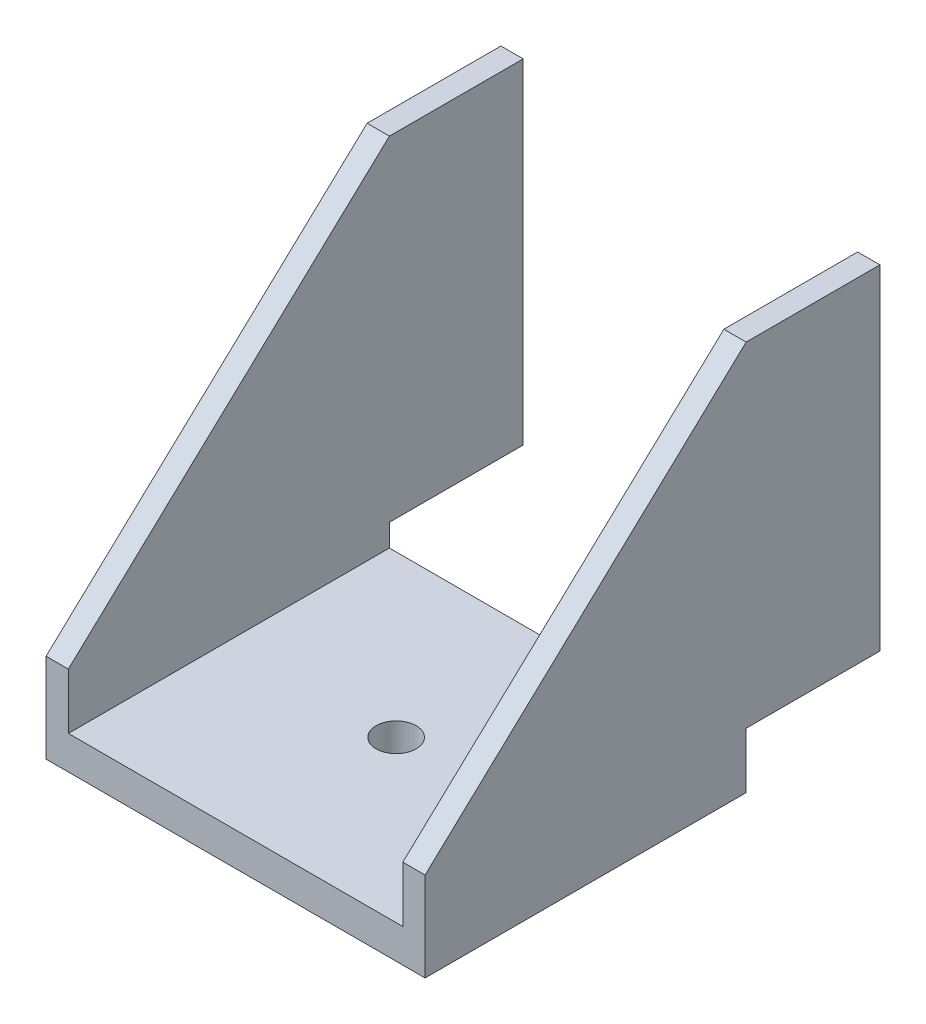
ISO-10303-21;
HEADER;
FILE_DESCRIPTION(('STEP AP214'),'2;1');
FILE_NAME('part.step','',(''),(''),'','','');
FILE_SCHEMA(('AUTOMOTIVE_DESIGN { 1 0 10303 214 1 1 1 1 }'));
ENDSEC;
DATA;
#1=APPLICATION_CONTEXT('core data for automotive mechanical design processes');
#2=APPLICATION_PROTOCOL_DEFINITION('international standard','automotive_design',2000,#1);
#3=PRODUCT_CONTEXT('',#1,'mechanical');
#4=PRODUCT('Part','Part','',(#3));
#5=PRODUCT_RELATED_PRODUCT_CATEGORY('part','',(#4));
#6=PRODUCT_DEFINITION_FORMATION('','',#4);
#7=PRODUCT_DEFINITION_CONTEXT('part definition',#1,'design');
#8=PRODUCT_DEFINITION('design','',#6,#7);
#9=PRODUCT_DEFINITION_SHAPE('','',#8);
#10=(LENGTH_UNIT() NAMED_UNIT(*) SI_UNIT(.MILLI.,.METRE.));
#11=(NAMED_UNIT(*) PLANE_ANGLE_UNIT() SI_UNIT($,.RADIAN.));
#12=(NAMED_UNIT(*) SI_UNIT($,.STERADIAN.) SOLID_ANGLE_UNIT());
#13=UNCERTAINTY_MEASURE_WITH_UNIT(LENGTH_MEASURE(1.E-05),#10,'distance_accuracy_value','');
#14=(GEOMETRIC_REPRESENTATION_CONTEXT(3) GLOBAL_UNCERTAINTY_ASSIGNED_CONTEXT((#13)) GLOBAL_UNIT_ASSIGNED_CONTEXT((#10,
#11,#12)) REPRESENTATION_CONTEXT('',''));
#15=CARTESIAN_POINT('',(0.,0.,0.));
#16=DIRECTION('',(0.,0.,1.));
#17=DIRECTION('',(1.,0.,0.));
#18=AXIS2_PLACEMENT_3D('',#15,#16,#17);
#19=CARTESIAN_POINT('',(0.,-9.99999999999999,0.));
#20=DIRECTION('',(0.,1.,0.));
#21=DIRECTION('',(0.,0.,1.));
#22=AXIS2_PLACEMENT_3D('',#19,#20,#21);
#23=PLANE('',#22);
#24=CARTESIAN_POINT('',(-75.,-10.,72.));
#25=DIRECTION('',(0.,-1.,0.));
#26=DIRECTION('',(0.,0.,-1.));
#27=AXIS2_PLACEMENT_3D('',#24,#25,#26);
#28=CIRCLE('',#27,8.99999999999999);
#29=CARTESIAN_POINT('',(-75.,-10.,63.));
#30=VERTEX_POINT('',#29);
#31=EDGE_CURVE('E350',#30,#30,#28,.T.);
#32=ORIENTED_EDGE('',*,*,#31,.T.);
#33=EDGE_LOOP('',(#32));
#34=FACE_BOUND('',#33,.T.);
#35=DIRECTION('',(1.,0.,0.));
#36=VECTOR('',#35,1.);
#37=CARTESIAN_POINT('',(10.,-9.99999999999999,0.));
#38=LINE('',#37,#36);
#39=CARTESIAN_POINT('',(-150.,-10.,0.));
#40=VERTEX_POINT('',#39);
#41=CARTESIAN_POINT('',(0.,-9.99999999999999,0.));
#42=VERTEX_POINT('',#41);
#43=EDGE_CURVE('E154',#40,#42,#38,.T.);
#44=ORIENTED_EDGE('',*,*,#43,.F.);
#45=DIRECTION('',(0.,0.,1.));
#46=VECTOR('',#45,1.);
#47=CARTESIAN_POINT('',(-150.,-9.99999999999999,0.));
#48=LINE('',#47,#46);
#49=CARTESIAN_POINT('',(-150.,-10.,144.));
#50=VERTEX_POINT('',#49);
#51=EDGE_CURVE('E11',#40,#50,#48,.T.);
#52=ORIENTED_EDGE('',*,*,#51,.T.);
#53=DIRECTION('',(-1.,0.,0.));
#54=VECTOR('',#53,1.);
#55=CARTESIAN_POINT('',(10.,-10.,144.));
#56=LINE('',#55,#54);
#57=CARTESIAN_POINT('',(0.,-10.,144.));
#58=VERTEX_POINT('',#57);
#59=EDGE_CURVE('E156',#58,#50,#56,.T.);
#60=ORIENTED_EDGE('',*,*,#59,.F.);
#61=DIRECTION('',(0.,0.,-1.));
#62=VECTOR('',#61,1.);
#63=CARTESIAN_POINT('',(0.,-9.99999999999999,0.));
#64=LINE('',#63,#62);
#65=EDGE_CURVE('E42',#58,#42,#64,.T.);
#66=ORIENTED_EDGE('',*,*,#65,.T.);
#67=EDGE_LOOP('',(#44,#52,#60,#66));
#68=FACE_BOUND('',#67,.T.);
#69=ADVANCED_FACE('F33',(#34,#68),#23,.T.);
#70=CARTESIAN_POINT('',(10.,150.,0.));
#71=DIRECTION('',(0.,-1.,0.));
#72=DIRECTION('',(0.,0.,-1.));
#73=AXIS2_PLACEMENT_3D('',#70,#71,#72);
#74=PLANE('',#73);
#75=DIRECTION('',(0.,0.,1.));
#76=VECTOR('',#75,1.);
#77=CARTESIAN_POINT('',(0.,150.,0.));
#78=LINE('',#77,#76);
#79=CARTESIAN_POINT('',(0.,150.,-60.));
#80=VERTEX_POINT('',#79);
#81=CARTESIAN_POINT('',(0.,150.,0.));
#82=VERTEX_POINT('',#81);
#83=EDGE_CURVE('E124',#80,#82,#78,.T.);
#84=ORIENTED_EDGE('',*,*,#83,.T.);
#85=DIRECTION('',(-1.,0.,0.));
#86=VECTOR('',#85,1.);
#87=CARTESIAN_POINT('',(10.,150.,0.));
#88=LINE('',#87,#86);
#89=CARTESIAN_POINT('',(10.,150.,0.));
#90=VERTEX_POINT('',#89);
#91=EDGE_CURVE('E146',#90,#82,#88,.T.);
#92=ORIENTED_EDGE('',*,*,#91,.F.);
#93=DIRECTION('',(0.,0.,1.));
#94=VECTOR('',#93,1.);
#95=CARTESIAN_POINT('',(10.,150.,0.));
#96=LINE('',#95,#94);
#97=CARTESIAN_POINT('',(10.,150.,-60.));
#98=VERTEX_POINT('',#97);
#99=EDGE_CURVE('E136',#98,#90,#96,.T.);
#100=ORIENTED_EDGE('',*,*,#99,.F.);
#101=DIRECTION('',(-1.,0.,0.));
#102=VECTOR('',#101,1.);
#103=CARTESIAN_POINT('',(10.,150.,-60.));
#104=LINE('',#103,#102);
#105=EDGE_CURVE('E120',#98,#80,#104,.T.);
#106=ORIENTED_EDGE('',*,*,#105,.T.);
#107=EDGE_LOOP('',(#84,#92,#100,#106));
#108=FACE_BOUND('',#107,.T.);
#109=ADVANCED_FACE('F35',(#108),#74,.F.);
#110=CARTESIAN_POINT('',(10.,15.,144.));
#111=DIRECTION('',(0.,-0.729537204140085,-0.68394112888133));
#112=DIRECTION('',(0.,0.68394112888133,-0.729537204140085));
#113=AXIS2_PLACEMENT_3D('',#110,#111,#112);
#114=PLANE('',#113);
#115=DIRECTION('',(0.,-0.68394112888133,0.729537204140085));
#116=VECTOR('',#115,1.);
#117=CARTESIAN_POINT('',(0.,15.,144.));
#118=LINE('',#117,#116);
#119=CARTESIAN_POINT('',(0.,15.,144.));
#120=VERTEX_POINT('',#119);
#121=EDGE_CURVE('E127',#82,#120,#118,.T.);
#122=ORIENTED_EDGE('',*,*,#121,.T.);
#123=DIRECTION('',(-1.,0.,0.));
#124=VECTOR('',#123,1.);
#125=CARTESIAN_POINT('',(10.,15.,144.));
#126=LINE('',#125,#124);
#127=CARTESIAN_POINT('',(10.,15.,144.));
#128=VERTEX_POINT('',#127);
#129=EDGE_CURVE('E143',#128,#120,#126,.T.);
#130=ORIENTED_EDGE('',*,*,#129,.F.);
#131=DIRECTION('',(0.,-0.68394112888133,0.729537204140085));
#132=VECTOR('',#131,1.);
#133=CARTESIAN_POINT('',(10.,15.,144.));
#134=LINE('',#133,#132);
#135=EDGE_CURVE('E86',#90,#128,#134,.T.);
#136=ORIENTED_EDGE('',*,*,#135,.F.);
#137=ORIENTED_EDGE('',*,*,#91,.T.);
#138=EDGE_LOOP('',(#122,#130,#136,#137));
#139=FACE_BOUND('',#138,.T.);
#140=ADVANCED_FACE('F181',(#139),#114,.F.);
#141=CARTESIAN_POINT('',(10.,-25.,144.));
#142=DIRECTION('',(0.,0.,-1.));
#143=DIRECTION('',(-1.,0.,0.));
#144=AXIS2_PLACEMENT_3D('',#141,#142,#143);
#145=PLANE('',#144);
#146=DIRECTION('',(0.,-1.,0.));
#147=VECTOR('',#146,1.);
#148=CARTESIAN_POINT('',(-160.,-10.,144.));
#149=LINE('',#148,#147);
#150=CARTESIAN_POINT('',(-160.,15.,144.));
#151=VERTEX_POINT('',#150);
#152=CARTESIAN_POINT('',(-160.,-25.,144.));
#153=VERTEX_POINT('',#152);
#154=EDGE_CURVE('E343',#151,#153,#149,.T.);
#155=ORIENTED_EDGE('',*,*,#154,.T.);
#156=DIRECTION('',(-1.,0.,0.));
#157=VECTOR('',#156,1.);
#158=CARTESIAN_POINT('',(10.,-25.,144.));
#159=LINE('',#158,#157);
#160=CARTESIAN_POINT('',(10.,-25.,144.));
#161=VERTEX_POINT('',#160);
#162=EDGE_CURVE('E140',#161,#153,#159,.T.);
#163=ORIENTED_EDGE('',*,*,#162,.F.);
#164=DIRECTION('',(0.,-1.,0.));
#165=VECTOR('',#164,1.);
#166=CARTESIAN_POINT('',(10.,-25.,144.));
#167=LINE('',#166,#165);
#168=EDGE_CURVE('E338',#128,#161,#167,.T.);
#169=ORIENTED_EDGE('',*,*,#168,.F.);
#170=ORIENTED_EDGE('',*,*,#129,.T.);
#171=DIRECTION('',(0.,-1.,0.));
#172=VECTOR('',#171,1.);
#173=CARTESIAN_POINT('',(0.,-25.,144.));
#174=LINE('',#173,#172);
#175=EDGE_CURVE('E130',#120,#58,#174,.T.);
#176=ORIENTED_EDGE('',*,*,#175,.T.);
#177=ORIENTED_EDGE('',*,*,#59,.T.);
#178=DIRECTION('',(0.,-1.,0.));
#179=VECTOR('',#178,1.);
#180=CARTESIAN_POINT('',(-150.,-25.,144.));
#181=LINE('',#180,#179);
#182=CARTESIAN_POINT('',(-150.,15.,144.));
#183=VERTEX_POINT('',#182);
#184=EDGE_CURVE('E394',#183,#50,#181,.T.);
#185=ORIENTED_EDGE('',*,*,#184,.F.);
#186=DIRECTION('',(-1.,0.,0.));
#187=VECTOR('',#186,1.);
#188=CARTESIAN_POINT('',(-150.,15.,144.));
#189=LINE('',#188,#187);
#190=EDGE_CURVE('E360',#183,#151,#189,.T.);
#191=ORIENTED_EDGE('',*,*,#190,.T.);
#192=EDGE_LOOP('',(#155,#163,#169,#170,#176,#177,#185,#191));
#193=FACE_BOUND('',#192,.T.);
#194=ADVANCED_FACE('F272',(#193),#145,.F.);
#195=CARTESIAN_POINT('',(10.,-25.,0.));
#196=DIRECTION('',(0.,1.,0.));
#197=DIRECTION('',(0.,0.,1.));
#198=AXIS2_PLACEMENT_3D('',#195,#196,#197);
#199=PLANE('',#198);
#200=DIRECTION('',(0.,0.,-1.));
#201=VECTOR('',#200,1.);
#202=CARTESIAN_POINT('',(-160.,-25.,144.));
#203=LINE('',#202,#201);
#204=CARTESIAN_POINT('',(-160.,-25.,0.));
#205=VERTEX_POINT('',#204);
#206=EDGE_CURVE('E347',#153,#205,#203,.T.);
#207=ORIENTED_EDGE('',*,*,#206,.T.);
#208=DIRECTION('',(-1.,0.,0.));
#209=VECTOR('',#208,1.);
#210=CARTESIAN_POINT('',(10.,-25.,0.));
#211=LINE('',#210,#209);
#212=CARTESIAN_POINT('',(10.,-25.,0.));
#213=VERTEX_POINT('',#212);
#214=EDGE_CURVE('E115',#213,#205,#211,.T.);
#215=ORIENTED_EDGE('',*,*,#214,.F.);
#216=DIRECTION('',(0.,0.,-1.));
#217=VECTOR('',#216,1.);
#218=CARTESIAN_POINT('',(10.,-25.,0.));
#219=LINE('',#218,#217);
#220=EDGE_CURVE('E104',#161,#213,#219,.T.);
#221=ORIENTED_EDGE('',*,*,#220,.F.);
#222=ORIENTED_EDGE('',*,*,#162,.T.);
#223=EDGE_LOOP('',(#207,#215,#221,#222));
#224=FACE_BOUND('',#223,.T.);
#225=CARTESIAN_POINT('',(-75.,-25.,72.));
#226=DIRECTION('',(0.,-1.,0.));
#227=DIRECTION('',(0.,0.,-1.));
#228=AXIS2_PLACEMENT_3D('',#225,#226,#227);
#229=CIRCLE('',#228,8.99999999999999);
#230=CARTESIAN_POINT('',(-75.,-25.,63.));
#231=VERTEX_POINT('',#230);
#232=EDGE_CURVE('E353',#231,#231,#229,.T.);
#233=ORIENTED_EDGE('',*,*,#232,.F.);
#234=EDGE_LOOP('',(#233));
#235=FACE_BOUND('',#234,.T.);
#236=ADVANCED_FACE('F262',(#224,#235),#199,.F.);
#237=CARTESIAN_POINT('',(10.,0.,0.));
#238=DIRECTION('',(0.,0.,1.));
#239=DIRECTION('',(0.,-1.,0.));
#240=AXIS2_PLACEMENT_3D('',#237,#238,#239);
#241=PLANE('',#240);
#242=DIRECTION('',(0.,-1.,0.));
#243=VECTOR('',#242,1.);
#244=CARTESIAN_POINT('',(-160.,-9.99999999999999,0.));
#245=LINE('',#244,#243);
#246=CARTESIAN_POINT('',(-160.,0.,0.));
#247=VERTEX_POINT('',#246);
#248=EDGE_CURVE('E128',#247,#205,#245,.T.);
#249=ORIENTED_EDGE('',*,*,#248,.F.);
#250=DIRECTION('',(-1.,0.,0.));
#251=VECTOR('',#250,1.);
#252=CARTESIAN_POINT('',(-150.,0.,0.));
#253=LINE('',#252,#251);
#254=CARTESIAN_POINT('',(-150.,0.,0.));
#255=VERTEX_POINT('',#254);
#256=EDGE_CURVE('E363',#255,#247,#253,.T.);
#257=ORIENTED_EDGE('',*,*,#256,.F.);
#258=DIRECTION('',(0.,1.,0.));
#259=VECTOR('',#258,1.);
#260=CARTESIAN_POINT('',(-150.,0.,0.));
#261=LINE('',#260,#259);
#262=EDGE_CURVE('E391',#40,#255,#261,.T.);
#263=ORIENTED_EDGE('',*,*,#262,.F.);
#264=ORIENTED_EDGE('',*,*,#43,.T.);
#265=DIRECTION('',(0.,1.,0.));
#266=VECTOR('',#265,1.);
#267=CARTESIAN_POINT('',(0.,0.,0.));
#268=LINE('',#267,#266);
#269=CARTESIAN_POINT('',(0.,0.,0.));
#270=VERTEX_POINT('',#269);
#271=EDGE_CURVE('E114',#42,#270,#268,.T.);
#272=ORIENTED_EDGE('',*,*,#271,.T.);
#273=DIRECTION('',(-1.,0.,0.));
#274=VECTOR('',#273,1.);
#275=CARTESIAN_POINT('',(10.,0.,0.));
#276=LINE('',#275,#274);
#277=CARTESIAN_POINT('',(10.,0.,0.));
#278=VERTEX_POINT('',#277);
#279=EDGE_CURVE('E109',#278,#270,#276,.T.);
#280=ORIENTED_EDGE('',*,*,#279,.F.);
#281=DIRECTION('',(0.,1.,0.));
#282=VECTOR('',#281,1.);
#283=CARTESIAN_POINT('',(10.,0.,0.));
#284=LINE('',#283,#282);
#285=EDGE_CURVE('E98',#213,#278,#284,.T.);
#286=ORIENTED_EDGE('',*,*,#285,.F.);
#287=ORIENTED_EDGE('',*,*,#214,.T.);
#288=EDGE_LOOP('',(#249,#257,#263,#264,#272,#280,#286,#287));
#289=FACE_BOUND('',#288,.T.);
#290=ADVANCED_FACE('F111',(#289),#241,.F.);
#291=CARTESIAN_POINT('',(10.,0.,-60.));
#292=DIRECTION('',(0.,1.,0.));
#293=DIRECTION('',(0.,0.,1.));
#294=AXIS2_PLACEMENT_3D('',#291,#292,#293);
#295=PLANE('',#294);
#296=DIRECTION('',(0.,0.,-1.));
#297=VECTOR('',#296,1.);
#298=CARTESIAN_POINT('',(0.,0.,-60.));
#299=LINE('',#298,#297);
#300=CARTESIAN_POINT('',(0.,0.,-60.));
#301=VERTEX_POINT('',#300);
#302=EDGE_CURVE('E71',#270,#301,#299,.T.);
#303=ORIENTED_EDGE('',*,*,#302,.T.);
#304=DIRECTION('',(-1.,0.,0.));
#305=VECTOR('',#304,1.);
#306=CARTESIAN_POINT('',(10.,0.,-60.));
#307=LINE('',#306,#305);
#308=CARTESIAN_POINT('',(10.,0.,-60.));
#309=VERTEX_POINT('',#308);
#310=EDGE_CURVE('E116',#309,#301,#307,.T.);
#311=ORIENTED_EDGE('',*,*,#310,.F.);
#312=DIRECTION('',(0.,0.,-1.));
#313=VECTOR('',#312,1.);
#314=CARTESIAN_POINT('',(10.,0.,-60.));
#315=LINE('',#314,#313);
#316=EDGE_CURVE('E102',#278,#309,#315,.T.);
#317=ORIENTED_EDGE('',*,*,#316,.F.);
#318=ORIENTED_EDGE('',*,*,#279,.T.);
#319=EDGE_LOOP('',(#303,#311,#317,#318));
#320=FACE_BOUND('',#319,.T.);
#321=ADVANCED_FACE('F118',(#320),#295,.F.);
#322=CARTESIAN_POINT('',(10.,150.,-60.));
#323=DIRECTION('',(0.,0.,1.));
#324=DIRECTION('',(0.,-1.,0.));
#325=AXIS2_PLACEMENT_3D('',#322,#323,#324);
#326=PLANE('',#325);
#327=DIRECTION('',(0.,1.,0.));
#328=VECTOR('',#327,1.);
#329=CARTESIAN_POINT('',(0.,150.,-60.));
#330=LINE('',#329,#328);
#331=EDGE_CURVE('E77',#301,#80,#330,.T.);
#332=ORIENTED_EDGE('',*,*,#331,.T.);
#333=ORIENTED_EDGE('',*,*,#105,.F.);
#334=DIRECTION('',(0.,1.,0.));
#335=VECTOR('',#334,1.);
#336=CARTESIAN_POINT('',(10.,150.,-60.));
#337=LINE('',#336,#335);
#338=EDGE_CURVE('E50',#309,#98,#337,.T.);
#339=ORIENTED_EDGE('',*,*,#338,.F.);
#340=ORIENTED_EDGE('',*,*,#310,.T.);
#341=EDGE_LOOP('',(#332,#333,#339,#340));
#342=FACE_BOUND('',#341,.T.);
#343=ADVANCED_FACE('F165',(#342),#326,.F.);
#344=CARTESIAN_POINT('',(10.,0.,0.));
#345=DIRECTION('',(-1.,0.,0.));
#346=DIRECTION('',(0.,0.,1.));
#347=AXIS2_PLACEMENT_3D('',#344,#345,#346);
#348=PLANE('',#347);
#349=ORIENTED_EDGE('',*,*,#168,.T.);
#350=ORIENTED_EDGE('',*,*,#220,.T.);
#351=ORIENTED_EDGE('',*,*,#285,.T.);
#352=ORIENTED_EDGE('',*,*,#316,.T.);
#353=ORIENTED_EDGE('',*,*,#338,.T.);
#354=ORIENTED_EDGE('',*,*,#99,.T.);
#355=ORIENTED_EDGE('',*,*,#135,.T.);
#356=EDGE_LOOP('',(#349,#350,#351,#352,#353,#354,#355));
#357=FACE_BOUND('',#356,.T.);
#358=ADVANCED_FACE('F100',(#357),#348,.F.);
#359=CARTESIAN_POINT('',(0.,0.,0.));
#360=DIRECTION('',(-1.,0.,0.));
#361=DIRECTION('',(0.,0.,1.));
#362=AXIS2_PLACEMENT_3D('',#359,#360,#361);
#363=PLANE('',#362);
#364=ORIENTED_EDGE('',*,*,#65,.F.);
#365=ORIENTED_EDGE('',*,*,#175,.F.);
#366=ORIENTED_EDGE('',*,*,#121,.F.);
#367=ORIENTED_EDGE('',*,*,#83,.F.);
#368=ORIENTED_EDGE('',*,*,#331,.F.);
#369=ORIENTED_EDGE('',*,*,#302,.F.);
#370=ORIENTED_EDGE('',*,*,#271,.F.);
#371=EDGE_LOOP('',(#364,#365,#366,#367,#368,#369,#370));
#372=FACE_BOUND('',#371,.T.);
#373=ADVANCED_FACE('F160',(#372),#363,.T.);
#374=CARTESIAN_POINT('',(-160.,-10.,144.));
#375=DIRECTION('',(-1.,0.,0.));
#376=DIRECTION('',(0.,0.,1.));
#377=AXIS2_PLACEMENT_3D('',#374,#375,#376);
#378=PLANE('',#377);
#379=ORIENTED_EDGE('',*,*,#206,.F.);
#380=ORIENTED_EDGE('',*,*,#154,.F.);
#381=DIRECTION('',(0.,-0.68394112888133,0.729537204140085));
#382=VECTOR('',#381,1.);
#383=CARTESIAN_POINT('',(-160.,15.,144.));
#384=LINE('',#383,#382);
#385=CARTESIAN_POINT('',(-160.,150.,0.));
#386=VERTEX_POINT('',#385);
#387=EDGE_CURVE('E380',#386,#151,#384,.T.);
#388=ORIENTED_EDGE('',*,*,#387,.F.);
#389=DIRECTION('',(0.,0.,1.));
#390=VECTOR('',#389,1.);
#391=CARTESIAN_POINT('',(-160.,150.,0.));
#392=LINE('',#391,#390);
#393=CARTESIAN_POINT('',(-160.,150.,-60.));
#394=VERTEX_POINT('',#393);
#395=EDGE_CURVE('E383',#394,#386,#392,.T.);
#396=ORIENTED_EDGE('',*,*,#395,.F.);
#397=DIRECTION('',(0.,1.,0.));
#398=VECTOR('',#397,1.);
#399=CARTESIAN_POINT('',(-160.,150.,-60.));
#400=LINE('',#399,#398);
#401=CARTESIAN_POINT('',(-160.,0.,-60.));
#402=VERTEX_POINT('',#401);
#403=EDGE_CURVE('E373',#402,#394,#400,.T.);
#404=ORIENTED_EDGE('',*,*,#403,.F.);
#405=DIRECTION('',(0.,0.,-1.));
#406=VECTOR('',#405,1.);
#407=CARTESIAN_POINT('',(-160.,0.,-60.));
#408=LINE('',#407,#406);
#409=EDGE_CURVE('E377',#247,#402,#408,.T.);
#410=ORIENTED_EDGE('',*,*,#409,.F.);
#411=ORIENTED_EDGE('',*,*,#248,.T.);
#412=EDGE_LOOP('',(#379,#380,#388,#396,#404,#410,#411));
#413=FACE_BOUND('',#412,.T.);
#414=ADVANCED_FACE('F187',(#413),#378,.T.);
#415=CARTESIAN_POINT('',(-75.,-10.,72.));
#416=DIRECTION('',(0.,-1.,0.));
#417=DIRECTION('',(0.,0.,-1.));
#418=AXIS2_PLACEMENT_3D('',#415,#416,#417);
#419=CYLINDRICAL_SURFACE('',#418,8.99999999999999);
#420=ORIENTED_EDGE('',*,*,#31,.F.);
#421=EDGE_LOOP('',(#420));
#422=FACE_BOUND('',#421,.T.);
#423=ORIENTED_EDGE('',*,*,#232,.T.);
#424=EDGE_LOOP('',(#423));
#425=FACE_BOUND('',#424,.T.);
#426=ADVANCED_FACE('F185',(#422,#425),#419,.F.);
#427=CARTESIAN_POINT('',(-150.,150.,0.));
#428=DIRECTION('',(0.,-1.,0.));
#429=DIRECTION('',(0.,0.,-1.));
#430=AXIS2_PLACEMENT_3D('',#427,#428,#429);
#431=PLANE('',#430);
#432=ORIENTED_EDGE('',*,*,#395,.T.);
#433=DIRECTION('',(-1.,0.,0.));
#434=VECTOR('',#433,1.);
#435=CARTESIAN_POINT('',(-150.,150.,0.));
#436=LINE('',#435,#434);
#437=CARTESIAN_POINT('',(-150.,150.,0.));
#438=VERTEX_POINT('',#437);
#439=EDGE_CURVE('E356',#438,#386,#436,.T.);
#440=ORIENTED_EDGE('',*,*,#439,.F.);
#441=DIRECTION('',(0.,0.,1.));
#442=VECTOR('',#441,1.);
#443=CARTESIAN_POINT('',(-150.,150.,0.));
#444=LINE('',#443,#442);
#445=CARTESIAN_POINT('',(-150.,150.,-60.));
#446=VERTEX_POINT('',#445);
#447=EDGE_CURVE('E376',#446,#438,#444,.T.);
#448=ORIENTED_EDGE('',*,*,#447,.F.);
#449=DIRECTION('',(-1.,0.,0.));
#450=VECTOR('',#449,1.);
#451=CARTESIAN_POINT('',(-150.,150.,-60.));
#452=LINE('',#451,#450);
#453=EDGE_CURVE('E369',#446,#394,#452,.T.);
#454=ORIENTED_EDGE('',*,*,#453,.T.);
#455=EDGE_LOOP('',(#432,#440,#448,#454));
#456=FACE_BOUND('',#455,.T.);
#457=ADVANCED_FACE('F205',(#456),#431,.F.);
#458=CARTESIAN_POINT('',(-150.,15.,144.));
#459=DIRECTION('',(0.,-0.729537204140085,-0.68394112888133));
#460=DIRECTION('',(0.,0.68394112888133,-0.729537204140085));
#461=AXIS2_PLACEMENT_3D('',#458,#459,#460);
#462=PLANE('',#461);
#463=ORIENTED_EDGE('',*,*,#387,.T.);
#464=ORIENTED_EDGE('',*,*,#190,.F.);
#465=DIRECTION('',(0.,-0.68394112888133,0.729537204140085));
#466=VECTOR('',#465,1.);
#467=CARTESIAN_POINT('',(-150.,15.,144.));
#468=LINE('',#467,#466);
#469=EDGE_CURVE('E397',#438,#183,#468,.T.);
#470=ORIENTED_EDGE('',*,*,#469,.F.);
#471=ORIENTED_EDGE('',*,*,#439,.T.);
#472=EDGE_LOOP('',(#463,#464,#470,#471));
#473=FACE_BOUND('',#472,.T.);
#474=ADVANCED_FACE('F212',(#473),#462,.F.);
#475=CARTESIAN_POINT('',(-150.,0.,-60.));
#476=DIRECTION('',(0.,1.,0.));
#477=DIRECTION('',(0.,0.,1.));
#478=AXIS2_PLACEMENT_3D('',#475,#476,#477);
#479=PLANE('',#478);
#480=ORIENTED_EDGE('',*,*,#409,.T.);
#481=DIRECTION('',(-1.,0.,0.));
#482=VECTOR('',#481,1.);
#483=CARTESIAN_POINT('',(-150.,0.,-60.));
#484=LINE('',#483,#482);
#485=CARTESIAN_POINT('',(-150.,0.,-60.));
#486=VERTEX_POINT('',#485);
#487=EDGE_CURVE('E366',#486,#402,#484,.T.);
#488=ORIENTED_EDGE('',*,*,#487,.F.);
#489=DIRECTION('',(0.,0.,-1.));
#490=VECTOR('',#489,1.);
#491=CARTESIAN_POINT('',(-150.,0.,-60.));
#492=LINE('',#491,#490);
#493=EDGE_CURVE('E388',#255,#486,#492,.T.);
#494=ORIENTED_EDGE('',*,*,#493,.F.);
#495=ORIENTED_EDGE('',*,*,#256,.T.);
#496=EDGE_LOOP('',(#480,#488,#494,#495));
#497=FACE_BOUND('',#496,.T.);
#498=ADVANCED_FACE('F219',(#497),#479,.F.);
#499=CARTESIAN_POINT('',(-150.,150.,-60.));
#500=DIRECTION('',(0.,0.,1.));
#501=DIRECTION('',(0.,-1.,0.));
#502=AXIS2_PLACEMENT_3D('',#499,#500,#501);
#503=PLANE('',#502);
#504=ORIENTED_EDGE('',*,*,#403,.T.);
#505=ORIENTED_EDGE('',*,*,#453,.F.);
#506=DIRECTION('',(0.,1.,0.));
#507=VECTOR('',#506,1.);
#508=CARTESIAN_POINT('',(-150.,150.,-60.));
#509=LINE('',#508,#507);
#510=EDGE_CURVE('E372',#486,#446,#509,.T.);
#511=ORIENTED_EDGE('',*,*,#510,.F.);
#512=ORIENTED_EDGE('',*,*,#487,.T.);
#513=EDGE_LOOP('',(#504,#505,#511,#512));
#514=FACE_BOUND('',#513,.T.);
#515=ADVANCED_FACE('F227',(#514),#503,.F.);
#516=CARTESIAN_POINT('',(-150.,0.,0.));
#517=DIRECTION('',(-1.,0.,0.));
#518=DIRECTION('',(0.,0.,1.));
#519=AXIS2_PLACEMENT_3D('',#516,#517,#518);
#520=PLANE('',#519);
#521=ORIENTED_EDGE('',*,*,#51,.F.);
#522=ORIENTED_EDGE('',*,*,#262,.T.);
#523=ORIENTED_EDGE('',*,*,#493,.T.);
#524=ORIENTED_EDGE('',*,*,#510,.T.);
#525=ORIENTED_EDGE('',*,*,#447,.T.);
#526=ORIENTED_EDGE('',*,*,#469,.T.);
#527=ORIENTED_EDGE('',*,*,#184,.T.);
#528=EDGE_LOOP('',(#521,#522,#523,#524,#525,#526,#527));
#529=FACE_BOUND('',#528,.T.);
#530=ADVANCED_FACE('F235',(#529),#520,.F.);
#531=CLOSED_SHELL('',(#69,#109,#140,#194,#236,#290,#321,#343,#358,#373,#414,#426,#457,#474,#498,
#515,#530));
#532=MANIFOLD_SOLID_BREP('B2',#531);
#533=ADVANCED_BREP_SHAPE_REPRESENTATION('',(#18,#532),#14);
#534=SHAPE_DEFINITION_REPRESENTATION(#9,#533);
ENDSEC;
END-ISO-10303-21;
